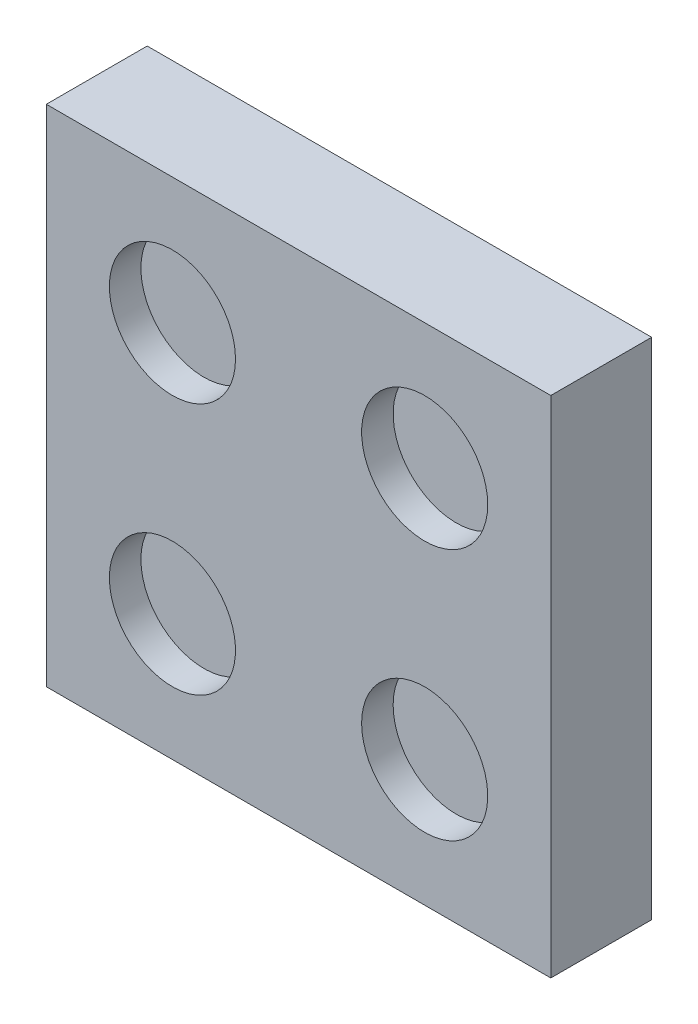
ISO-10303-21;
HEADER;
FILE_DESCRIPTION(('STEP AP214'),'2;1');
FILE_NAME('part.step','',(''),(''),'','','');
FILE_SCHEMA(('AUTOMOTIVE_DESIGN { 1 0 10303 214 1 1 1 1 }'));
ENDSEC;
DATA;
#1=APPLICATION_CONTEXT('core data for automotive mechanical design processes');
#2=APPLICATION_PROTOCOL_DEFINITION('international standard','automotive_design',2000,#1);
#3=PRODUCT_CONTEXT('',#1,'mechanical');
#4=PRODUCT('Part','Part','',(#3));
#5=PRODUCT_RELATED_PRODUCT_CATEGORY('part','',(#4));
#6=PRODUCT_DEFINITION_FORMATION('','',#4);
#7=PRODUCT_DEFINITION_CONTEXT('part definition',#1,'design');
#8=PRODUCT_DEFINITION('design','',#6,#7);
#9=PRODUCT_DEFINITION_SHAPE('','',#8);
#10=(LENGTH_UNIT() NAMED_UNIT(*) SI_UNIT(.MILLI.,.METRE.));
#11=(NAMED_UNIT(*) PLANE_ANGLE_UNIT() SI_UNIT($,.RADIAN.));
#12=(NAMED_UNIT(*) SI_UNIT($,.STERADIAN.) SOLID_ANGLE_UNIT());
#13=UNCERTAINTY_MEASURE_WITH_UNIT(LENGTH_MEASURE(1.E-05),#10,'distance_accuracy_value','');
#14=(GEOMETRIC_REPRESENTATION_CONTEXT(3) GLOBAL_UNCERTAINTY_ASSIGNED_CONTEXT((#13)) GLOBAL_UNIT_ASSIGNED_CONTEXT((#10,
#11,#12)) REPRESENTATION_CONTEXT('',''));
#15=CARTESIAN_POINT('',(0.,0.,0.));
#16=DIRECTION('',(0.,0.,1.));
#17=DIRECTION('',(1.,0.,0.));
#18=AXIS2_PLACEMENT_3D('',#15,#16,#17);
#19=CARTESIAN_POINT('',(0.,0.,10.16));
#20=DIRECTION('',(0.,0.,-1.));
#21=DIRECTION('',(-1.,0.,0.));
#22=AXIS2_PLACEMENT_3D('',#19,#20,#21);
#23=PLANE('',#22);
#24=CARTESIAN_POINT('',(38.1,38.1,10.16));
#25=DIRECTION('',(0.,0.,1.));
#26=DIRECTION('',(1.,0.,0.));
#27=AXIS2_PLACEMENT_3D('',#24,#25,#26);
#28=CIRCLE('',#27,6.35);
#29=CARTESIAN_POINT('',(44.45,38.1,10.16));
#30=VERTEX_POINT('',#29);
#31=EDGE_CURVE('E200',#30,#30,#28,.T.);
#32=ORIENTED_EDGE('',*,*,#31,.F.);
#33=EDGE_LOOP('',(#32));
#34=FACE_BOUND('',#33,.T.);
#35=CARTESIAN_POINT('',(12.7,12.7,10.16));
#36=DIRECTION('',(0.,0.,-1.));
#37=DIRECTION('',(-1.,0.,0.));
#38=AXIS2_PLACEMENT_3D('',#35,#36,#37);
#39=CIRCLE('',#38,6.35);
#40=CARTESIAN_POINT('',(6.35,12.7,10.16));
#41=VERTEX_POINT('',#40);
#42=EDGE_CURVE('E192',#41,#41,#39,.T.);
#43=ORIENTED_EDGE('',*,*,#42,.T.);
#44=EDGE_LOOP('',(#43));
#45=FACE_BOUND('',#44,.T.);
#46=DIRECTION('',(0.,-1.,0.));
#47=VECTOR('',#46,1.);
#48=CARTESIAN_POINT('',(0.,0.,10.16));
#49=LINE('',#48,#47);
#50=CARTESIAN_POINT('',(0.,50.8,10.16));
#51=VERTEX_POINT('',#50);
#52=CARTESIAN_POINT('',(0.,0.,10.16));
#53=VERTEX_POINT('',#52);
#54=EDGE_CURVE('E216',#51,#53,#49,.T.);
#55=ORIENTED_EDGE('',*,*,#54,.T.);
#56=DIRECTION('',(1.,0.,0.));
#57=VECTOR('',#56,1.);
#58=CARTESIAN_POINT('',(0.,0.,10.16));
#59=LINE('',#58,#57);
#60=CARTESIAN_POINT('',(50.8,0.,10.16));
#61=VERTEX_POINT('',#60);
#62=EDGE_CURVE('E98',#53,#61,#59,.T.);
#63=ORIENTED_EDGE('',*,*,#62,.T.);
#64=DIRECTION('',(0.,1.,0.));
#65=VECTOR('',#64,1.);
#66=CARTESIAN_POINT('',(50.8,0.,10.16));
#67=LINE('',#66,#65);
#68=CARTESIAN_POINT('',(50.8,50.8,10.16));
#69=VERTEX_POINT('',#68);
#70=EDGE_CURVE('E221',#61,#69,#67,.T.);
#71=ORIENTED_EDGE('',*,*,#70,.T.);
#72=DIRECTION('',(-1.,0.,0.));
#73=VECTOR('',#72,1.);
#74=CARTESIAN_POINT('',(0.,50.8,10.16));
#75=LINE('',#74,#73);
#76=EDGE_CURVE('E70',#69,#51,#75,.T.);
#77=ORIENTED_EDGE('',*,*,#76,.T.);
#78=EDGE_LOOP('',(#55,#63,#71,#77));
#79=FACE_BOUND('',#78,.T.);
#80=CARTESIAN_POINT('',(38.1,12.7,10.16));
#81=DIRECTION('',(0.,0.,-1.));
#82=DIRECTION('',(-1.,0.,0.));
#83=AXIS2_PLACEMENT_3D('',#80,#81,#82);
#84=CIRCLE('',#83,6.35);
#85=CARTESIAN_POINT('',(31.75,12.7,10.16));
#86=VERTEX_POINT('',#85);
#87=EDGE_CURVE('E184',#86,#86,#84,.T.);
#88=ORIENTED_EDGE('',*,*,#87,.T.);
#89=EDGE_LOOP('',(#88));
#90=FACE_BOUND('',#89,.T.);
#91=CARTESIAN_POINT('',(12.7,38.1,10.16));
#92=DIRECTION('',(0.,0.,1.));
#93=DIRECTION('',(1.,0.,0.));
#94=AXIS2_PLACEMENT_3D('',#91,#92,#93);
#95=CIRCLE('',#94,6.35);
#96=CARTESIAN_POINT('',(19.05,38.1,10.16));
#97=VERTEX_POINT('',#96);
#98=EDGE_CURVE('E208',#97,#97,#95,.T.);
#99=ORIENTED_EDGE('',*,*,#98,.F.);
#100=EDGE_LOOP('',(#99));
#101=FACE_BOUND('',#100,.T.);
#102=ADVANCED_FACE('F45',(#34,#45,#79,#90,#101),#23,.F.);
#103=CARTESIAN_POINT('',(0.,0.,10.16));
#104=DIRECTION('',(1.,0.,0.));
#105=DIRECTION('',(0.,0.,-1.));
#106=AXIS2_PLACEMENT_3D('',#103,#104,#105);
#107=PLANE('',#106);
#108=DIRECTION('',(0.,-1.,0.));
#109=VECTOR('',#108,1.);
#110=CARTESIAN_POINT('',(0.,0.,0.));
#111=LINE('',#110,#109);
#112=CARTESIAN_POINT('',(0.,50.8,0.));
#113=VERTEX_POINT('',#112);
#114=CARTESIAN_POINT('',(0.,0.,0.));
#115=VERTEX_POINT('',#114);
#116=EDGE_CURVE('E212',#113,#115,#111,.T.);
#117=ORIENTED_EDGE('',*,*,#116,.T.);
#118=DIRECTION('',(0.,0.,-1.));
#119=VECTOR('',#118,1.);
#120=CARTESIAN_POINT('',(0.,0.,10.16));
#121=LINE('',#120,#119);
#122=EDGE_CURVE('E11',#53,#115,#121,.T.);
#123=ORIENTED_EDGE('',*,*,#122,.F.);
#124=ORIENTED_EDGE('',*,*,#54,.F.);
#125=DIRECTION('',(0.,0.,-1.));
#126=VECTOR('',#125,1.);
#127=CARTESIAN_POINT('',(0.,50.8,10.16));
#128=LINE('',#127,#126);
#129=EDGE_CURVE('E226',#51,#113,#128,.T.);
#130=ORIENTED_EDGE('',*,*,#129,.T.);
#131=EDGE_LOOP('',(#117,#123,#124,#130));
#132=FACE_BOUND('',#131,.T.);
#133=ADVANCED_FACE('F47',(#132),#107,.F.);
#134=CARTESIAN_POINT('',(0.,0.,10.16));
#135=DIRECTION('',(0.,1.,0.));
#136=DIRECTION('',(0.,0.,1.));
#137=AXIS2_PLACEMENT_3D('',#134,#135,#136);
#138=PLANE('',#137);
#139=DIRECTION('',(1.,0.,0.));
#140=VECTOR('',#139,1.);
#141=CARTESIAN_POINT('',(0.,0.,0.));
#142=LINE('',#141,#140);
#143=CARTESIAN_POINT('',(24.0221307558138,0.,0.));
#144=VERTEX_POINT('',#143);
#145=EDGE_CURVE('E231',#115,#144,#142,.T.);
#146=ORIENTED_EDGE('',*,*,#145,.T.);
#147=DIRECTION('',(0.,0.,-1.));
#148=VECTOR('',#147,1.);
#149=CARTESIAN_POINT('',(24.0221307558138,0.,5.08));
#150=LINE('',#149,#148);
#151=CARTESIAN_POINT('',(24.0221307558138,0.,5.08));
#152=VERTEX_POINT('',#151);
#153=EDGE_CURVE('E165',#152,#144,#150,.T.);
#154=ORIENTED_EDGE('',*,*,#153,.F.);
#155=DIRECTION('',(-1.,0.,0.));
#156=VECTOR('',#155,1.);
#157=CARTESIAN_POINT('',(24.0221307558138,0.,5.08));
#158=LINE('',#157,#156);
#159=CARTESIAN_POINT('',(26.5621307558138,0.,5.08));
#160=VERTEX_POINT('',#159);
#161=EDGE_CURVE('E137',#160,#152,#158,.T.);
#162=ORIENTED_EDGE('',*,*,#161,.F.);
#163=DIRECTION('',(0.,0.,-1.));
#164=VECTOR('',#163,1.);
#165=CARTESIAN_POINT('',(26.5621307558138,0.,5.08));
#166=LINE('',#165,#164);
#167=CARTESIAN_POINT('',(26.5621307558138,0.,0.));
#168=VERTEX_POINT('',#167);
#169=EDGE_CURVE('E168',#160,#168,#166,.T.);
#170=ORIENTED_EDGE('',*,*,#169,.T.);
#171=CARTESIAN_POINT('',(50.8,0.,0.));
#172=VERTEX_POINT('',#171);
#173=EDGE_CURVE('E230',#168,#172,#142,.T.);
#174=ORIENTED_EDGE('',*,*,#173,.T.);
#175=DIRECTION('',(0.,0.,-1.));
#176=VECTOR('',#175,1.);
#177=CARTESIAN_POINT('',(50.8,0.,10.16));
#178=LINE('',#177,#176);
#179=EDGE_CURVE('E54',#61,#172,#178,.T.);
#180=ORIENTED_EDGE('',*,*,#179,.F.);
#181=ORIENTED_EDGE('',*,*,#62,.F.);
#182=ORIENTED_EDGE('',*,*,#122,.T.);
#183=EDGE_LOOP('',(#146,#154,#162,#170,#174,#180,#181,#182));
#184=FACE_BOUND('',#183,.T.);
#185=ADVANCED_FACE('F269',(#184),#138,.F.);
#186=CARTESIAN_POINT('',(50.8,0.,10.16));
#187=DIRECTION('',(-1.,0.,0.));
#188=DIRECTION('',(0.,0.,1.));
#189=AXIS2_PLACEMENT_3D('',#186,#187,#188);
#190=PLANE('',#189);
#191=DIRECTION('',(0.,1.,0.));
#192=VECTOR('',#191,1.);
#193=CARTESIAN_POINT('',(50.8,0.,0.));
#194=LINE('',#193,#192);
#195=CARTESIAN_POINT('',(50.8,50.8,0.));
#196=VERTEX_POINT('',#195);
#197=EDGE_CURVE('E235',#172,#196,#194,.T.);
#198=ORIENTED_EDGE('',*,*,#197,.T.);
#199=DIRECTION('',(0.,0.,-1.));
#200=VECTOR('',#199,1.);
#201=CARTESIAN_POINT('',(50.8,50.8,10.16));
#202=LINE('',#201,#200);
#203=EDGE_CURVE('E242',#69,#196,#202,.T.);
#204=ORIENTED_EDGE('',*,*,#203,.F.);
#205=ORIENTED_EDGE('',*,*,#70,.F.);
#206=ORIENTED_EDGE('',*,*,#179,.T.);
#207=EDGE_LOOP('',(#198,#204,#205,#206));
#208=FACE_BOUND('',#207,.T.);
#209=ADVANCED_FACE('F249',(#208),#190,.F.);
#210=CARTESIAN_POINT('',(0.,50.8,10.16));
#211=DIRECTION('',(0.,-1.,0.));
#212=DIRECTION('',(0.,0.,-1.));
#213=AXIS2_PLACEMENT_3D('',#210,#211,#212);
#214=PLANE('',#213);
#215=DIRECTION('',(-1.,0.,0.));
#216=VECTOR('',#215,1.);
#217=CARTESIAN_POINT('',(0.,50.8,0.));
#218=LINE('',#217,#216);
#219=EDGE_CURVE('E91',#196,#113,#218,.T.);
#220=ORIENTED_EDGE('',*,*,#219,.T.);
#221=ORIENTED_EDGE('',*,*,#129,.F.);
#222=ORIENTED_EDGE('',*,*,#76,.F.);
#223=ORIENTED_EDGE('',*,*,#203,.T.);
#224=EDGE_LOOP('',(#220,#221,#222,#223));
#225=FACE_BOUND('',#224,.T.);
#226=ADVANCED_FACE('F259',(#225),#214,.F.);
#227=CARTESIAN_POINT('',(0.,0.,0.));
#228=DIRECTION('',(0.,0.,-1.));
#229=DIRECTION('',(-1.,0.,0.));
#230=AXIS2_PLACEMENT_3D('',#227,#228,#229);
#231=PLANE('',#230);
#232=DIRECTION('',(0.,-1.,0.));
#233=VECTOR('',#232,1.);
#234=CARTESIAN_POINT('',(26.5621307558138,0.,0.));
#235=LINE('',#234,#233);
#236=CARTESIAN_POINT('',(26.5621307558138,12.7532829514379,0.));
#237=VERTEX_POINT('',#236);
#238=EDGE_CURVE('E151',#237,#168,#235,.T.);
#239=ORIENTED_EDGE('',*,*,#238,.F.);
#240=CARTESIAN_POINT('',(25.4,25.4,0.));
#241=DIRECTION('',(0.,0.,-1.));
#242=DIRECTION('',(-1.,0.,0.));
#243=AXIS2_PLACEMENT_3D('',#240,#241,#242);
#244=CIRCLE('',#243,12.7);
#245=CARTESIAN_POINT('',(24.2378692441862,12.7532829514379,0.));
#246=VERTEX_POINT('',#245);
#247=EDGE_CURVE('E176',#246,#237,#244,.T.);
#248=ORIENTED_EDGE('',*,*,#247,.F.);
#249=DIRECTION('',(1.,0.,0.));
#250=VECTOR('',#249,1.);
#251=CARTESIAN_POINT('',(24.0221307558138,12.7532829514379,0.));
#252=LINE('',#251,#250);
#253=CARTESIAN_POINT('',(24.0221307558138,12.7532829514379,0.));
#254=VERTEX_POINT('',#253);
#255=EDGE_CURVE('E154',#254,#246,#252,.T.);
#256=ORIENTED_EDGE('',*,*,#255,.F.);
#257=DIRECTION('',(0.,1.,0.));
#258=VECTOR('',#257,1.);
#259=CARTESIAN_POINT('',(24.0221307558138,0.,0.));
#260=LINE('',#259,#258);
#261=EDGE_CURVE('E132',#144,#254,#260,.T.);
#262=ORIENTED_EDGE('',*,*,#261,.F.);
#263=ORIENTED_EDGE('',*,*,#145,.F.);
#264=ORIENTED_EDGE('',*,*,#116,.F.);
#265=ORIENTED_EDGE('',*,*,#219,.F.);
#266=ORIENTED_EDGE('',*,*,#197,.F.);
#267=ORIENTED_EDGE('',*,*,#173,.F.);
#268=EDGE_LOOP('',(#239,#248,#256,#262,#263,#264,#265,#266,#267));
#269=FACE_BOUND('',#268,.T.);
#270=ADVANCED_FACE('F254',(#269),#231,.T.);
#271=CARTESIAN_POINT('',(12.7,12.7,6.985));
#272=DIRECTION('',(0.,0.,1.));
#273=DIRECTION('',(1.,0.,0.));
#274=AXIS2_PLACEMENT_3D('',#271,#272,#273);
#275=CYLINDRICAL_SURFACE('',#274,6.35);
#276=CARTESIAN_POINT('',(12.7,12.7,6.985));
#277=DIRECTION('',(0.,0.,-1.));
#278=DIRECTION('',(-1.,0.,0.));
#279=AXIS2_PLACEMENT_3D('',#276,#277,#278);
#280=CIRCLE('',#279,6.35);
#281=CARTESIAN_POINT('',(6.35,12.7,6.985));
#282=VERTEX_POINT('',#281);
#283=EDGE_CURVE('E188',#282,#282,#280,.T.);
#284=ORIENTED_EDGE('',*,*,#283,.T.);
#285=EDGE_LOOP('',(#284));
#286=FACE_BOUND('',#285,.T.);
#287=ORIENTED_EDGE('',*,*,#42,.F.);
#288=EDGE_LOOP('',(#287));
#289=FACE_BOUND('',#288,.T.);
#290=ADVANCED_FACE('F267',(#286,#289),#275,.F.);
#291=CARTESIAN_POINT('',(12.7,12.7,6.985));
#292=DIRECTION('',(0.,0.,-1.));
#293=DIRECTION('',(-1.,0.,0.));
#294=AXIS2_PLACEMENT_3D('',#291,#292,#293);
#295=PLANE('',#294);
#296=ORIENTED_EDGE('',*,*,#283,.F.);
#297=EDGE_LOOP('',(#296));
#298=FACE_BOUND('',#297,.T.);
#299=ADVANCED_FACE('F298',(#298),#295,.F.);
#300=CARTESIAN_POINT('',(38.1,38.1,6.985));
#301=DIRECTION('',(0.,0.,1.));
#302=DIRECTION('',(1.,0.,0.));
#303=AXIS2_PLACEMENT_3D('',#300,#301,#302);
#304=CYLINDRICAL_SURFACE('',#303,6.35);
#305=CARTESIAN_POINT('',(38.1,38.1,6.985));
#306=DIRECTION('',(0.,0.,1.));
#307=DIRECTION('',(1.,0.,0.));
#308=AXIS2_PLACEMENT_3D('',#305,#306,#307);
#309=CIRCLE('',#308,6.35);
#310=CARTESIAN_POINT('',(44.45,38.1,6.985));
#311=VERTEX_POINT('',#310);
#312=EDGE_CURVE('E196',#311,#311,#309,.T.);
#313=ORIENTED_EDGE('',*,*,#312,.F.);
#314=EDGE_LOOP('',(#313));
#315=FACE_BOUND('',#314,.T.);
#316=ORIENTED_EDGE('',*,*,#31,.T.);
#317=EDGE_LOOP('',(#316));
#318=FACE_BOUND('',#317,.T.);
#319=ADVANCED_FACE('F294',(#315,#318),#304,.F.);
#320=CARTESIAN_POINT('',(38.1,38.1,6.985));
#321=DIRECTION('',(0.,0.,1.));
#322=DIRECTION('',(1.,0.,0.));
#323=AXIS2_PLACEMENT_3D('',#320,#321,#322);
#324=PLANE('',#323);
#325=ORIENTED_EDGE('',*,*,#312,.T.);
#326=EDGE_LOOP('',(#325));
#327=FACE_BOUND('',#326,.T.);
#328=ADVANCED_FACE('F290',(#327),#324,.T.);
#329=CARTESIAN_POINT('',(38.1,12.7,6.985));
#330=DIRECTION('',(0.,0.,1.));
#331=DIRECTION('',(1.,0.,0.));
#332=AXIS2_PLACEMENT_3D('',#329,#330,#331);
#333=CYLINDRICAL_SURFACE('',#332,6.35);
#334=CARTESIAN_POINT('',(38.1,12.7,6.985));
#335=DIRECTION('',(0.,0.,-1.));
#336=DIRECTION('',(-1.,0.,0.));
#337=AXIS2_PLACEMENT_3D('',#334,#335,#336);
#338=CIRCLE('',#337,6.35);
#339=CARTESIAN_POINT('',(31.75,12.7,6.985));
#340=VERTEX_POINT('',#339);
#341=EDGE_CURVE('E180',#340,#340,#338,.T.);
#342=ORIENTED_EDGE('',*,*,#341,.T.);
#343=EDGE_LOOP('',(#342));
#344=FACE_BOUND('',#343,.T.);
#345=ORIENTED_EDGE('',*,*,#87,.F.);
#346=EDGE_LOOP('',(#345));
#347=FACE_BOUND('',#346,.T.);
#348=ADVANCED_FACE('F293',(#344,#347),#333,.F.);
#349=CARTESIAN_POINT('',(38.1,12.7,6.985));
#350=DIRECTION('',(0.,0.,-1.));
#351=DIRECTION('',(-1.,0.,0.));
#352=AXIS2_PLACEMENT_3D('',#349,#350,#351);
#353=PLANE('',#352);
#354=ORIENTED_EDGE('',*,*,#341,.F.);
#355=EDGE_LOOP('',(#354));
#356=FACE_BOUND('',#355,.T.);
#357=ADVANCED_FACE('F288',(#356),#353,.F.);
#358=CARTESIAN_POINT('',(12.7,38.1,6.985));
#359=DIRECTION('',(0.,0.,1.));
#360=DIRECTION('',(1.,0.,0.));
#361=AXIS2_PLACEMENT_3D('',#358,#359,#360);
#362=CYLINDRICAL_SURFACE('',#361,6.35);
#363=CARTESIAN_POINT('',(12.7,38.1,6.985));
#364=DIRECTION('',(0.,0.,1.));
#365=DIRECTION('',(1.,0.,0.));
#366=AXIS2_PLACEMENT_3D('',#363,#364,#365);
#367=CIRCLE('',#366,6.35);
#368=CARTESIAN_POINT('',(19.05,38.1,6.985));
#369=VERTEX_POINT('',#368);
#370=EDGE_CURVE('E204',#369,#369,#367,.T.);
#371=ORIENTED_EDGE('',*,*,#370,.F.);
#372=EDGE_LOOP('',(#371));
#373=FACE_BOUND('',#372,.T.);
#374=ORIENTED_EDGE('',*,*,#98,.T.);
#375=EDGE_LOOP('',(#374));
#376=FACE_BOUND('',#375,.T.);
#377=ADVANCED_FACE('F284',(#373,#376),#362,.F.);
#378=CARTESIAN_POINT('',(12.7,38.1,6.985));
#379=DIRECTION('',(0.,0.,1.));
#380=DIRECTION('',(1.,0.,0.));
#381=AXIS2_PLACEMENT_3D('',#378,#379,#380);
#382=PLANE('',#381);
#383=ORIENTED_EDGE('',*,*,#370,.T.);
#384=EDGE_LOOP('',(#383));
#385=FACE_BOUND('',#384,.T.);
#386=ADVANCED_FACE('F280',(#385),#382,.T.);
#387=CARTESIAN_POINT('',(25.4,25.4,5.08));
#388=DIRECTION('',(0.,0.,-1.));
#389=DIRECTION('',(-1.,0.,0.));
#390=AXIS2_PLACEMENT_3D('',#387,#388,#389);
#391=CYLINDRICAL_SURFACE('',#390,12.7);
#392=ORIENTED_EDGE('',*,*,#247,.T.);
#393=DIRECTION('',(0.,0.,-1.));
#394=VECTOR('',#393,1.);
#395=CARTESIAN_POINT('',(26.5621307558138,12.7532829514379,5.08));
#396=LINE('',#395,#394);
#397=CARTESIAN_POINT('',(26.5621307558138,12.7532829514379,5.08));
#398=VERTEX_POINT('',#397);
#399=EDGE_CURVE('E136',#398,#237,#396,.T.);
#400=ORIENTED_EDGE('',*,*,#399,.F.);
#401=CARTESIAN_POINT('',(25.4,25.4,5.08));
#402=DIRECTION('',(0.,0.,-1.));
#403=DIRECTION('',(-1.,0.,0.));
#404=AXIS2_PLACEMENT_3D('',#401,#402,#403);
#405=CIRCLE('',#404,12.7);
#406=CARTESIAN_POINT('',(24.2378692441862,12.7532829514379,5.08));
#407=VERTEX_POINT('',#406);
#408=EDGE_CURVE('E177',#407,#398,#405,.T.);
#409=ORIENTED_EDGE('',*,*,#408,.F.);
#410=DIRECTION('',(0.,0.,-1.));
#411=VECTOR('',#410,1.);
#412=CARTESIAN_POINT('',(24.2378692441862,12.7532829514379,5.08));
#413=LINE('',#412,#411);
#414=EDGE_CURVE('E141',#407,#246,#413,.T.);
#415=ORIENTED_EDGE('',*,*,#414,.T.);
#416=EDGE_LOOP('',(#392,#400,#409,#415));
#417=FACE_BOUND('',#416,.T.);
#418=ADVANCED_FACE('F283',(#417),#391,.F.);
#419=CARTESIAN_POINT('',(25.4,25.4,5.08));
#420=DIRECTION('',(0.,0.,-1.));
#421=DIRECTION('',(-1.,0.,0.));
#422=AXIS2_PLACEMENT_3D('',#419,#420,#421);
#423=PLANE('',#422);
#424=ORIENTED_EDGE('',*,*,#408,.T.);
#425=DIRECTION('',(0.,-1.,0.));
#426=VECTOR('',#425,1.);
#427=CARTESIAN_POINT('',(26.5621307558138,0.,5.08));
#428=LINE('',#427,#426);
#429=EDGE_CURVE('E144',#398,#160,#428,.T.);
#430=ORIENTED_EDGE('',*,*,#429,.T.);
#431=ORIENTED_EDGE('',*,*,#161,.T.);
#432=DIRECTION('',(0.,1.,0.));
#433=VECTOR('',#432,1.);
#434=CARTESIAN_POINT('',(24.0221307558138,0.,5.08));
#435=LINE('',#434,#433);
#436=CARTESIAN_POINT('',(24.0221307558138,12.7532829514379,5.08));
#437=VERTEX_POINT('',#436);
#438=EDGE_CURVE('E129',#152,#437,#435,.T.);
#439=ORIENTED_EDGE('',*,*,#438,.T.);
#440=DIRECTION('',(1.,0.,0.));
#441=VECTOR('',#440,1.);
#442=CARTESIAN_POINT('',(24.0221307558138,12.7532829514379,5.08));
#443=LINE('',#442,#441);
#444=EDGE_CURVE('E61',#437,#407,#443,.T.);
#445=ORIENTED_EDGE('',*,*,#444,.T.);
#446=EDGE_LOOP('',(#424,#430,#431,#439,#445));
#447=FACE_BOUND('',#446,.T.);
#448=ADVANCED_FACE('F146',(#447),#423,.T.);
#449=CARTESIAN_POINT('',(24.0221307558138,12.7532829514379,5.08));
#450=DIRECTION('',(0.,1.,0.));
#451=DIRECTION('',(-1.,0.,0.));
#452=AXIS2_PLACEMENT_3D('',#449,#450,#451);
#453=PLANE('',#452);
#454=ORIENTED_EDGE('',*,*,#444,.F.);
#455=DIRECTION('',(0.,0.,-1.));
#456=VECTOR('',#455,1.);
#457=CARTESIAN_POINT('',(24.0221307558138,12.7532829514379,5.08));
#458=LINE('',#457,#456);
#459=EDGE_CURVE('E127',#437,#254,#458,.T.);
#460=ORIENTED_EDGE('',*,*,#459,.T.);
#461=ORIENTED_EDGE('',*,*,#255,.T.);
#462=ORIENTED_EDGE('',*,*,#414,.F.);
#463=EDGE_LOOP('',(#454,#460,#461,#462));
#464=FACE_BOUND('',#463,.T.);
#465=ADVANCED_FACE('F139',(#464),#453,.F.);
#466=CARTESIAN_POINT('',(24.0221307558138,0.,5.08));
#467=DIRECTION('',(-1.,0.,0.));
#468=DIRECTION('',(0.,0.,1.));
#469=AXIS2_PLACEMENT_3D('',#466,#467,#468);
#470=PLANE('',#469);
#471=ORIENTED_EDGE('',*,*,#261,.T.);
#472=ORIENTED_EDGE('',*,*,#459,.F.);
#473=ORIENTED_EDGE('',*,*,#438,.F.);
#474=ORIENTED_EDGE('',*,*,#153,.T.);
#475=EDGE_LOOP('',(#471,#472,#473,#474));
#476=FACE_BOUND('',#475,.T.);
#477=ADVANCED_FACE('F128',(#476),#470,.F.);
#478=CARTESIAN_POINT('',(26.5621307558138,0.,5.08));
#479=DIRECTION('',(1.,0.,0.));
#480=DIRECTION('',(0.,0.,-1.));
#481=AXIS2_PLACEMENT_3D('',#478,#479,#480);
#482=PLANE('',#481);
#483=ORIENTED_EDGE('',*,*,#238,.T.);
#484=ORIENTED_EDGE('',*,*,#169,.F.);
#485=ORIENTED_EDGE('',*,*,#429,.F.);
#486=ORIENTED_EDGE('',*,*,#399,.T.);
#487=EDGE_LOOP('',(#483,#484,#485,#486));
#488=FACE_BOUND('',#487,.T.);
#489=ADVANCED_FACE('F318',(#488),#482,.F.);
#490=CLOSED_SHELL('',(#102,#133,#185,#209,#226,#270,#290,#299,#319,#328,#348,#357,#377,#386,
#418,#448,#465,#477,#489));
#491=MANIFOLD_SOLID_BREP('B2',#490);
#492=ADVANCED_BREP_SHAPE_REPRESENTATION('',(#18,#491),#14);
#493=SHAPE_DEFINITION_REPRESENTATION(#9,#492);
ENDSEC;
END-ISO-10303-21;
